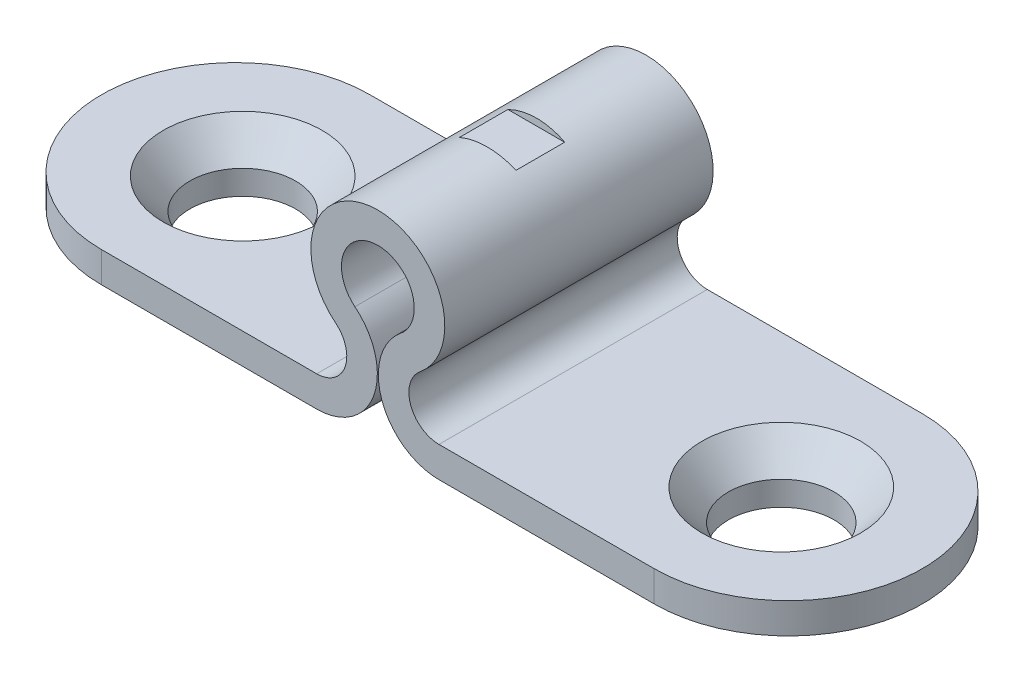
ISO-10303-21;
HEADER;
FILE_DESCRIPTION(('STEP AP214'),'2;1');
FILE_NAME('part.step','',(''),(''),'','','');
FILE_SCHEMA(('AUTOMOTIVE_DESIGN { 1 0 10303 214 1 1 1 1 }'));
ENDSEC;
DATA;
#1=APPLICATION_CONTEXT('core data for automotive mechanical design processes');
#2=APPLICATION_PROTOCOL_DEFINITION('international standard','automotive_design',2000,#1);
#3=PRODUCT_CONTEXT('',#1,'mechanical');
#4=PRODUCT('Part','Part','',(#3));
#5=PRODUCT_RELATED_PRODUCT_CATEGORY('part','',(#4));
#6=PRODUCT_DEFINITION_FORMATION('','',#4);
#7=PRODUCT_DEFINITION_CONTEXT('part definition',#1,'design');
#8=PRODUCT_DEFINITION('design','',#6,#7);
#9=PRODUCT_DEFINITION_SHAPE('','',#8);
#10=(LENGTH_UNIT() NAMED_UNIT(*) SI_UNIT(.MILLI.,.METRE.));
#11=(NAMED_UNIT(*) PLANE_ANGLE_UNIT() SI_UNIT($,.RADIAN.));
#12=(NAMED_UNIT(*) SI_UNIT($,.STERADIAN.) SOLID_ANGLE_UNIT());
#13=UNCERTAINTY_MEASURE_WITH_UNIT(LENGTH_MEASURE(1.E-05),#10,'distance_accuracy_value','');
#14=(GEOMETRIC_REPRESENTATION_CONTEXT(3) GLOBAL_UNCERTAINTY_ASSIGNED_CONTEXT((#13)) GLOBAL_UNIT_ASSIGNED_CONTEXT((#10,
#11,#12)) REPRESENTATION_CONTEXT('',''));
#15=CARTESIAN_POINT('',(0.,0.,0.));
#16=DIRECTION('',(0.,0.,1.));
#17=DIRECTION('',(1.,0.,0.));
#18=AXIS2_PLACEMENT_3D('',#15,#16,#17);
#19=CARTESIAN_POINT('',(-21.4884,0.0680967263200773,7.0231));
#20=DIRECTION('',(0.,1.,0.));
#21=DIRECTION('',(-1.,0.,0.));
#22=AXIS2_PLACEMENT_3D('',#19,#20,#21);
#23=PLANE('',#22);
#24=CARTESIAN_POINT('',(-14.097,0.068096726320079,0.));
#25=DIRECTION('',(0.,1.,0.));
#26=DIRECTION('',(-1.,0.,0.));
#27=AXIS2_PLACEMENT_3D('',#24,#25,#26);
#28=CIRCLE('',#27,5.1308);
#29=CARTESIAN_POINT('',(-19.2278,0.0680967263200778,0.));
#30=VERTEX_POINT('',#29);
#31=EDGE_CURVE('E11',#30,#30,#28,.T.);
#32=ORIENTED_EDGE('',*,*,#31,.T.);
#33=EDGE_LOOP('',(#32));
#34=FACE_BOUND('',#33,.T.);
#35=DIRECTION('',(1.,0.,0.));
#36=VECTOR('',#35,1.);
#37=CARTESIAN_POINT('',(-21.4884,0.0680967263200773,7.0231));
#38=LINE('',#37,#36);
#39=CARTESIAN_POINT('',(-14.4653,0.0680967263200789,7.0231));
#40=VERTEX_POINT('',#39);
#41=CARTESIAN_POINT('',(-3.2004,0.0680967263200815,7.0231));
#42=VERTEX_POINT('',#41);
#43=EDGE_CURVE('E195',#40,#42,#38,.T.);
#44=ORIENTED_EDGE('',*,*,#43,.F.);
#45=CARTESIAN_POINT('',(-14.4653,0.0680967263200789,0.));
#46=DIRECTION('',(0.,1.,0.));
#47=DIRECTION('',(-1.,0.,0.));
#48=AXIS2_PLACEMENT_3D('',#45,#46,#47);
#49=CIRCLE('',#48,7.0231);
#50=CARTESIAN_POINT('',(-14.4653,0.0680967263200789,-7.0231));
#51=VERTEX_POINT('',#50);
#52=EDGE_CURVE('E56',#40,#51,#49,.F.);
#53=ORIENTED_EDGE('',*,*,#52,.T.);
#54=DIRECTION('',(1.,0.,0.));
#55=VECTOR('',#54,1.);
#56=CARTESIAN_POINT('',(-21.4884,0.0680967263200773,-7.0231));
#57=LINE('',#56,#55);
#58=CARTESIAN_POINT('',(-3.2004,0.0680967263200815,-7.0231));
#59=VERTEX_POINT('',#58);
#60=EDGE_CURVE('E218',#51,#59,#57,.T.);
#61=ORIENTED_EDGE('',*,*,#60,.T.);
#62=DIRECTION('',(0.,0.,-1.));
#63=VECTOR('',#62,1.);
#64=CARTESIAN_POINT('',(-3.2004,0.0680967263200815,7.0231));
#65=LINE('',#64,#63);
#66=EDGE_CURVE('E234',#42,#59,#65,.T.);
#67=ORIENTED_EDGE('',*,*,#66,.F.);
#68=EDGE_LOOP('',(#44,#53,#61,#67));
#69=FACE_BOUND('',#68,.T.);
#70=ADVANCED_FACE('F34',(#34,#69),#23,.F.);
#71=CARTESIAN_POINT('',(-14.4653,0.0680967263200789,0.));
#72=DIRECTION('',(0.,-1.,0.));
#73=DIRECTION('',(0.,0.,-1.));
#74=AXIS2_PLACEMENT_3D('',#71,#72,#73);
#75=CYLINDRICAL_SURFACE('',#74,7.0231);
#76=DIRECTION('',(0.,1.,0.));
#77=VECTOR('',#76,1.);
#78=CARTESIAN_POINT('',(-14.4653,0.0680967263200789,-7.0231));
#79=LINE('',#78,#77);
#80=CARTESIAN_POINT('',(-14.4653,1.66829672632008,-7.0231));
#81=VERTEX_POINT('',#80);
#82=EDGE_CURVE('E259',#51,#81,#79,.T.);
#83=ORIENTED_EDGE('',*,*,#82,.F.);
#84=ORIENTED_EDGE('',*,*,#52,.F.);
#85=DIRECTION('',(0.,-1.,0.));
#86=VECTOR('',#85,1.);
#87=CARTESIAN_POINT('',(-14.4653,3.24309672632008,7.0231));
#88=LINE('',#87,#86);
#89=CARTESIAN_POINT('',(-14.4653,1.66829672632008,7.0231));
#90=VERTEX_POINT('',#89);
#91=EDGE_CURVE('E262',#90,#40,#88,.T.);
#92=ORIENTED_EDGE('',*,*,#91,.F.);
#93=CARTESIAN_POINT('',(-14.4653,1.66829672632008,0.));
#94=DIRECTION('',(0.,-1.,0.));
#95=DIRECTION('',(1.,0.,0.));
#96=AXIS2_PLACEMENT_3D('',#93,#94,#95);
#97=CIRCLE('',#96,7.0231);
#98=EDGE_CURVE('E265',#81,#90,#97,.F.);
#99=ORIENTED_EDGE('',*,*,#98,.F.);
#100=EDGE_LOOP('',(#83,#84,#92,#99));
#101=FACE_BOUND('',#100,.T.);
#102=ADVANCED_FACE('F293',(#101),#75,.T.);
#103=CARTESIAN_POINT('',(14.4653,0.0680967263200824,0.));
#104=DIRECTION('',(0.,1.,0.));
#105=DIRECTION('',(0.,0.,1.));
#106=AXIS2_PLACEMENT_3D('',#103,#104,#105);
#107=CYLINDRICAL_SURFACE('',#106,7.0231);
#108=DIRECTION('',(0.,1.,0.));
#109=VECTOR('',#108,1.);
#110=CARTESIAN_POINT('',(14.4653,3.24309672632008,7.0231));
#111=LINE('',#110,#109);
#112=CARTESIAN_POINT('',(14.4653,0.0680967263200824,7.0231));
#113=VERTEX_POINT('',#112);
#114=CARTESIAN_POINT('',(14.4653,1.66829672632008,7.0231));
#115=VERTEX_POINT('',#114);
#116=EDGE_CURVE('E249',#113,#115,#111,.T.);
#117=ORIENTED_EDGE('',*,*,#116,.F.);
#118=CARTESIAN_POINT('',(14.4653,0.0680967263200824,0.));
#119=DIRECTION('',(0.,1.,0.));
#120=DIRECTION('',(-1.,0.,0.));
#121=AXIS2_PLACEMENT_3D('',#118,#119,#120);
#122=CIRCLE('',#121,7.0231);
#123=CARTESIAN_POINT('',(14.4653,0.0680967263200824,-7.0231));
#124=VERTEX_POINT('',#123);
#125=EDGE_CURVE('E255',#124,#113,#122,.F.);
#126=ORIENTED_EDGE('',*,*,#125,.F.);
#127=DIRECTION('',(0.,-1.,0.));
#128=VECTOR('',#127,1.);
#129=CARTESIAN_POINT('',(14.4653,0.0680967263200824,-7.0231));
#130=LINE('',#129,#128);
#131=CARTESIAN_POINT('',(14.4653,1.66829672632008,-7.0231));
#132=VERTEX_POINT('',#131);
#133=EDGE_CURVE('E252',#132,#124,#130,.T.);
#134=ORIENTED_EDGE('',*,*,#133,.F.);
#135=CARTESIAN_POINT('',(14.4653,1.66829672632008,0.));
#136=DIRECTION('',(0.,-1.,0.));
#137=DIRECTION('',(1.,0.,0.));
#138=AXIS2_PLACEMENT_3D('',#135,#136,#137);
#139=CIRCLE('',#138,7.0231);
#140=EDGE_CURVE('E257',#115,#132,#139,.F.);
#141=ORIENTED_EDGE('',*,*,#140,.F.);
#142=EDGE_LOOP('',(#117,#126,#134,#141));
#143=FACE_BOUND('',#142,.T.);
#144=ADVANCED_FACE('F299',(#143),#107,.T.);
#145=CARTESIAN_POINT('',(21.4884,0.0680967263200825,7.0231));
#146=DIRECTION('',(0.,1.,0.));
#147=DIRECTION('',(-1.,0.,0.));
#148=AXIS2_PLACEMENT_3D('',#145,#146,#147);
#149=PLANE('',#148);
#150=CARTESIAN_POINT('',(14.097,0.0680967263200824,0.));
#151=DIRECTION('',(0.,1.,0.));
#152=DIRECTION('',(-1.,0.,0.));
#153=AXIS2_PLACEMENT_3D('',#150,#151,#152);
#154=CIRCLE('',#153,5.1308);
#155=CARTESIAN_POINT('',(8.9662,0.0680967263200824,0.));
#156=VERTEX_POINT('',#155);
#157=EDGE_CURVE('E267',#156,#156,#154,.T.);
#158=ORIENTED_EDGE('',*,*,#157,.T.);
#159=EDGE_LOOP('',(#158));
#160=FACE_BOUND('',#159,.T.);
#161=DIRECTION('',(1.,0.,0.));
#162=VECTOR('',#161,1.);
#163=CARTESIAN_POINT('',(21.4884,0.0680967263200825,-7.0231));
#164=LINE('',#163,#162);
#165=CARTESIAN_POINT('',(3.2004,0.0680967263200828,-7.0231));
#166=VERTEX_POINT('',#165);
#167=EDGE_CURVE('E179',#166,#124,#164,.T.);
#168=ORIENTED_EDGE('',*,*,#167,.T.);
#169=ORIENTED_EDGE('',*,*,#125,.T.);
#170=DIRECTION('',(1.,0.,0.));
#171=VECTOR('',#170,1.);
#172=CARTESIAN_POINT('',(21.4884,0.0680967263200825,7.0231));
#173=LINE('',#172,#171);
#174=CARTESIAN_POINT('',(3.2004,0.0680967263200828,7.0231));
#175=VERTEX_POINT('',#174);
#176=EDGE_CURVE('E180',#175,#113,#173,.T.);
#177=ORIENTED_EDGE('',*,*,#176,.F.);
#178=DIRECTION('',(0.,0.,-1.));
#179=VECTOR('',#178,1.);
#180=CARTESIAN_POINT('',(3.2004,0.0680967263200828,7.0231));
#181=LINE('',#180,#179);
#182=EDGE_CURVE('E203',#175,#166,#181,.T.);
#183=ORIENTED_EDGE('',*,*,#182,.T.);
#184=EDGE_LOOP('',(#168,#169,#177,#183));
#185=FACE_BOUND('',#184,.T.);
#186=ADVANCED_FACE('F323',(#160,#185),#149,.F.);
#187=CARTESIAN_POINT('',(21.4884,1.66829672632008,7.0231));
#188=DIRECTION('',(0.,-1.,0.));
#189=DIRECTION('',(1.,0.,0.));
#190=AXIS2_PLACEMENT_3D('',#187,#188,#189);
#191=PLANE('',#190);
#192=CARTESIAN_POINT('',(14.097,1.66829672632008,0.));
#193=DIRECTION('',(0.,-1.,0.));
#194=DIRECTION('',(1.,0.,0.));
#195=AXIS2_PLACEMENT_3D('',#192,#193,#194);
#196=CIRCLE('',#195,4.15963263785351);
#197=CARTESIAN_POINT('',(18.2566326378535,1.66829672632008,0.));
#198=VERTEX_POINT('',#197);
#199=EDGE_CURVE('E166',#198,#198,#196,.T.);
#200=ORIENTED_EDGE('',*,*,#199,.T.);
#201=EDGE_LOOP('',(#200));
#202=FACE_BOUND('',#201,.T.);
#203=DIRECTION('',(-1.,0.,0.));
#204=VECTOR('',#203,1.);
#205=CARTESIAN_POINT('',(21.4884,1.66829672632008,7.0231));
#206=LINE('',#205,#204);
#207=CARTESIAN_POINT('',(3.2004,1.66829672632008,7.0231));
#208=VERTEX_POINT('',#207);
#209=EDGE_CURVE('E183',#115,#208,#206,.T.);
#210=ORIENTED_EDGE('',*,*,#209,.F.);
#211=ORIENTED_EDGE('',*,*,#140,.T.);
#212=DIRECTION('',(-1.,0.,0.));
#213=VECTOR('',#212,1.);
#214=CARTESIAN_POINT('',(21.4884,1.66829672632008,-7.0231));
#215=LINE('',#214,#213);
#216=CARTESIAN_POINT('',(3.2004,1.66829672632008,-7.0231));
#217=VERTEX_POINT('',#216);
#218=EDGE_CURVE('E206',#132,#217,#215,.T.);
#219=ORIENTED_EDGE('',*,*,#218,.T.);
#220=DIRECTION('',(0.,0.,-1.));
#221=VECTOR('',#220,1.);
#222=CARTESIAN_POINT('',(3.2004,1.66829672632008,7.0231));
#223=LINE('',#222,#221);
#224=EDGE_CURVE('E246',#208,#217,#223,.T.);
#225=ORIENTED_EDGE('',*,*,#224,.F.);
#226=EDGE_LOOP('',(#210,#211,#219,#225));
#227=FACE_BOUND('',#226,.T.);
#228=ADVANCED_FACE('F319',(#202,#227),#191,.F.);
#229=CARTESIAN_POINT('',(3.2004,3.24309672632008,7.0231));
#230=DIRECTION('',(0.,0.,-1.));
#231=DIRECTION('',(-1.,0.,0.));
#232=AXIS2_PLACEMENT_3D('',#229,#230,#231);
#233=CYLINDRICAL_SURFACE('',#232,1.5748);
#234=CARTESIAN_POINT('',(3.2004,3.24309672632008,-7.0231));
#235=DIRECTION('',(0.,0.,-1.));
#236=DIRECTION('',(-1.,0.,0.));
#237=AXIS2_PLACEMENT_3D('',#234,#235,#236);
#238=CIRCLE('',#237,1.5748);
#239=CARTESIAN_POINT('',(2.208276,4.46607874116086,-7.0231));
#240=VERTEX_POINT('',#239);
#241=EDGE_CURVE('E208',#217,#240,#238,.T.);
#242=ORIENTED_EDGE('',*,*,#241,.T.);
#243=DIRECTION('',(0.,0.,-1.));
#244=VECTOR('',#243,1.);
#245=CARTESIAN_POINT('',(2.208276,4.46607874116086,7.0231));
#246=LINE('',#245,#244);
#247=CARTESIAN_POINT('',(2.208276,4.46607874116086,7.0231));
#248=VERTEX_POINT('',#247);
#249=EDGE_CURVE('E243',#248,#240,#246,.T.);
#250=ORIENTED_EDGE('',*,*,#249,.F.);
#251=CARTESIAN_POINT('',(3.2004,3.24309672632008,7.0231));
#252=DIRECTION('',(0.,0.,-1.));
#253=DIRECTION('',(-1.,0.,0.));
#254=AXIS2_PLACEMENT_3D('',#251,#252,#253);
#255=CIRCLE('',#254,1.5748);
#256=EDGE_CURVE('E186',#208,#248,#255,.T.);
#257=ORIENTED_EDGE('',*,*,#256,.F.);
#258=ORIENTED_EDGE('',*,*,#224,.T.);
#259=EDGE_LOOP('',(#242,#250,#257,#258));
#260=FACE_BOUND('',#259,.T.);
#261=ADVANCED_FACE('F316',(#260),#233,.F.);
#262=CARTESIAN_POINT('',(0.,7.1882,7.0231));
#263=DIRECTION('',(0.,0.,-1.));
#264=DIRECTION('',(-1.,0.,0.));
#265=AXIS2_PLACEMENT_3D('',#262,#263,#264);
#266=CYLINDRICAL_SURFACE('',#265,3.5052);
#267=DIRECTION('',(0.,0.,-1.));
#268=VECTOR('',#267,1.);
#269=CARTESIAN_POINT('',(-1.4856753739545,10.3629749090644,7.0231));
#270=LINE('',#269,#268);
#271=CARTESIAN_POINT('',(-1.4856753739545,10.3629749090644,-1.27));
#272=VERTEX_POINT('',#271);
#273=CARTESIAN_POINT('',(-1.4856753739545,10.3629749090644,1.27));
#274=VERTEX_POINT('',#273);
#275=EDGE_CURVE('E141',#272,#274,#270,.F.);
#276=ORIENTED_EDGE('',*,*,#275,.F.);
#277=CARTESIAN_POINT('',(0.,7.1882,-0.992243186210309));
#278=DIRECTION('',(0.,-0.0871557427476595,-0.996194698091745));
#279=DIRECTION('',(0.,0.996194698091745,-0.0871557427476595));
#280=AXIS2_PLACEMENT_3D('',#277,#278,#279);
#281=ELLIPSE('',#280,3.51858929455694,3.5052);
#282=CARTESIAN_POINT('',(1.4856753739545,10.3629749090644,-1.27));
#283=VERTEX_POINT('',#282);
#284=EDGE_CURVE('E149',#283,#272,#281,.F.);
#285=ORIENTED_EDGE('',*,*,#284,.F.);
#286=DIRECTION('',(0.,0.,-1.));
#287=VECTOR('',#286,1.);
#288=CARTESIAN_POINT('',(1.4856753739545,10.3629749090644,7.0231));
#289=LINE('',#288,#287);
#290=CARTESIAN_POINT('',(1.4856753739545,10.3629749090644,1.27));
#291=VERTEX_POINT('',#290);
#292=EDGE_CURVE('E138',#283,#291,#289,.F.);
#293=ORIENTED_EDGE('',*,*,#292,.T.);
#294=CARTESIAN_POINT('',(0.,7.1882,0.992243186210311));
#295=DIRECTION('',(0.,-0.0871557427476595,0.996194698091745));
#296=DIRECTION('',(0.,-0.996194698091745,-0.0871557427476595));
#297=AXIS2_PLACEMENT_3D('',#294,#295,#296);
#298=ELLIPSE('',#297,3.51858929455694,3.5052);
#299=EDGE_CURVE('E146',#274,#291,#298,.F.);
#300=ORIENTED_EDGE('',*,*,#299,.F.);
#301=EDGE_LOOP('',(#276,#285,#293,#300));
#302=FACE_BOUND('',#301,.T.);
#303=CARTESIAN_POINT('',(0.,7.1882,-7.0231));
#304=DIRECTION('',(0.,0.,1.));
#305=DIRECTION('',(1.,0.,0.));
#306=AXIS2_PLACEMENT_3D('',#303,#304,#305);
#307=CIRCLE('',#306,3.5052);
#308=CARTESIAN_POINT('',(-2.208276,4.46607874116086,-7.0231));
#309=VERTEX_POINT('',#308);
#310=EDGE_CURVE('E211',#240,#309,#307,.T.);
#311=ORIENTED_EDGE('',*,*,#310,.T.);
#312=DIRECTION('',(0.,0.,-1.));
#313=VECTOR('',#312,1.);
#314=CARTESIAN_POINT('',(-2.208276,4.46607874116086,7.0231));
#315=LINE('',#314,#313);
#316=CARTESIAN_POINT('',(-2.208276,4.46607874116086,7.0231));
#317=VERTEX_POINT('',#316);
#318=EDGE_CURVE('E240',#317,#309,#315,.T.);
#319=ORIENTED_EDGE('',*,*,#318,.F.);
#320=CARTESIAN_POINT('',(0.,7.1882,7.0231));
#321=DIRECTION('',(0.,0.,1.));
#322=DIRECTION('',(-1.,0.,0.));
#323=AXIS2_PLACEMENT_3D('',#320,#321,#322);
#324=CIRCLE('',#323,3.5052);
#325=EDGE_CURVE('E188',#248,#317,#324,.T.);
#326=ORIENTED_EDGE('',*,*,#325,.F.);
#327=ORIENTED_EDGE('',*,*,#249,.T.);
#328=EDGE_LOOP('',(#311,#319,#326,#327));
#329=FACE_BOUND('',#328,.T.);
#330=ADVANCED_FACE('F151',(#302,#329),#266,.T.);
#331=CARTESIAN_POINT('',(-3.2004,3.24309672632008,7.0231));
#332=DIRECTION('',(0.,0.,-1.));
#333=DIRECTION('',(-1.,0.,0.));
#334=AXIS2_PLACEMENT_3D('',#331,#332,#333);
#335=CYLINDRICAL_SURFACE('',#334,1.5748);
#336=CARTESIAN_POINT('',(-3.2004,3.24309672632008,-7.0231));
#337=DIRECTION('',(0.,0.,-1.));
#338=DIRECTION('',(1.,0.,0.));
#339=AXIS2_PLACEMENT_3D('',#336,#337,#338);
#340=CIRCLE('',#339,1.5748);
#341=CARTESIAN_POINT('',(-3.2004,1.66829672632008,-7.0231));
#342=VERTEX_POINT('',#341);
#343=EDGE_CURVE('E213',#309,#342,#340,.T.);
#344=ORIENTED_EDGE('',*,*,#343,.T.);
#345=DIRECTION('',(0.,0.,-1.));
#346=VECTOR('',#345,1.);
#347=CARTESIAN_POINT('',(-3.2004,1.66829672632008,7.0231));
#348=LINE('',#347,#346);
#349=CARTESIAN_POINT('',(-3.2004,1.66829672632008,7.0231));
#350=VERTEX_POINT('',#349);
#351=EDGE_CURVE('E237',#350,#342,#348,.T.);
#352=ORIENTED_EDGE('',*,*,#351,.F.);
#353=CARTESIAN_POINT('',(-3.2004,3.24309672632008,7.0231));
#354=DIRECTION('',(0.,0.,-1.));
#355=DIRECTION('',(1.,0.,0.));
#356=AXIS2_PLACEMENT_3D('',#353,#354,#355);
#357=CIRCLE('',#356,1.5748);
#358=EDGE_CURVE('E190',#317,#350,#357,.T.);
#359=ORIENTED_EDGE('',*,*,#358,.F.);
#360=ORIENTED_EDGE('',*,*,#318,.T.);
#361=EDGE_LOOP('',(#344,#352,#359,#360));
#362=FACE_BOUND('',#361,.T.);
#363=ADVANCED_FACE('F309',(#362),#335,.F.);
#364=CARTESIAN_POINT('',(-21.4884,1.66829672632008,7.0231));
#365=DIRECTION('',(0.,-1.,0.));
#366=DIRECTION('',(1.,0.,0.));
#367=AXIS2_PLACEMENT_3D('',#364,#365,#366);
#368=PLANE('',#367);
#369=CARTESIAN_POINT('',(-14.097,1.66829672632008,0.));
#370=DIRECTION('',(0.,-1.,0.));
#371=DIRECTION('',(1.,0.,0.));
#372=AXIS2_PLACEMENT_3D('',#369,#370,#371);
#373=CIRCLE('',#372,4.15963263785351);
#374=CARTESIAN_POINT('',(-9.93736736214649,1.66829672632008,0.));
#375=VERTEX_POINT('',#374);
#376=EDGE_CURVE('E176',#375,#375,#373,.T.);
#377=ORIENTED_EDGE('',*,*,#376,.T.);
#378=EDGE_LOOP('',(#377));
#379=FACE_BOUND('',#378,.T.);
#380=DIRECTION('',(-1.,0.,0.));
#381=VECTOR('',#380,1.);
#382=CARTESIAN_POINT('',(-21.4884,1.66829672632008,-7.0231));
#383=LINE('',#382,#381);
#384=EDGE_CURVE('E215',#342,#81,#383,.T.);
#385=ORIENTED_EDGE('',*,*,#384,.T.);
#386=ORIENTED_EDGE('',*,*,#98,.T.);
#387=DIRECTION('',(-1.,0.,0.));
#388=VECTOR('',#387,1.);
#389=CARTESIAN_POINT('',(-21.4884,1.66829672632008,7.0231));
#390=LINE('',#389,#388);
#391=EDGE_CURVE('E192',#350,#90,#390,.T.);
#392=ORIENTED_EDGE('',*,*,#391,.F.);
#393=ORIENTED_EDGE('',*,*,#351,.T.);
#394=EDGE_LOOP('',(#385,#386,#392,#393));
#395=FACE_BOUND('',#394,.T.);
#396=ADVANCED_FACE('F306',(#379,#395),#368,.F.);
#397=CARTESIAN_POINT('',(-3.2004,3.24309672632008,7.0231));
#398=DIRECTION('',(0.,0.,-1.));
#399=DIRECTION('',(-1.,0.,0.));
#400=AXIS2_PLACEMENT_3D('',#397,#398,#399);
#401=CYLINDRICAL_SURFACE('',#400,3.175);
#402=CARTESIAN_POINT('',(-3.2004,3.24309672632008,-7.0231));
#403=DIRECTION('',(0.,0.,1.));
#404=DIRECTION('',(1.,0.,0.));
#405=AXIS2_PLACEMENT_3D('',#402,#403,#404);
#406=CIRCLE('',#405,3.175);
#407=CARTESIAN_POINT('',(-1.20015,5.70878627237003,-7.0231));
#408=VERTEX_POINT('',#407);
#409=EDGE_CURVE('E220',#59,#408,#406,.T.);
#410=ORIENTED_EDGE('',*,*,#409,.T.);
#411=DIRECTION('',(0.,0.,-1.));
#412=VECTOR('',#411,1.);
#413=CARTESIAN_POINT('',(-1.20015,5.70878627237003,7.0231));
#414=LINE('',#413,#412);
#415=CARTESIAN_POINT('',(-1.20015,5.70878627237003,7.0231));
#416=VERTEX_POINT('',#415);
#417=EDGE_CURVE('E231',#416,#408,#414,.T.);
#418=ORIENTED_EDGE('',*,*,#417,.F.);
#419=CARTESIAN_POINT('',(-3.2004,3.24309672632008,7.0231));
#420=DIRECTION('',(0.,0.,1.));
#421=DIRECTION('',(1.,0.,0.));
#422=AXIS2_PLACEMENT_3D('',#419,#420,#421);
#423=CIRCLE('',#422,3.175);
#424=EDGE_CURVE('E197',#42,#416,#423,.T.);
#425=ORIENTED_EDGE('',*,*,#424,.F.);
#426=ORIENTED_EDGE('',*,*,#66,.T.);
#427=EDGE_LOOP('',(#410,#418,#425,#426));
#428=FACE_BOUND('',#427,.T.);
#429=ADVANCED_FACE('F304',(#428),#401,.T.);
#430=CARTESIAN_POINT('',(0.,7.1882,7.0231));
#431=DIRECTION('',(0.,0.,-1.));
#432=DIRECTION('',(-1.,0.,0.));
#433=AXIS2_PLACEMENT_3D('',#430,#431,#432);
#434=CYLINDRICAL_SURFACE('',#433,1.905);
#435=CARTESIAN_POINT('',(0.,7.1882,-7.0231));
#436=DIRECTION('',(0.,0.,-1.));
#437=DIRECTION('',(-1.,0.,0.));
#438=AXIS2_PLACEMENT_3D('',#435,#436,#437);
#439=CIRCLE('',#438,1.905);
#440=CARTESIAN_POINT('',(1.20015,5.70878627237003,-7.0231));
#441=VERTEX_POINT('',#440);
#442=EDGE_CURVE('E223',#408,#441,#439,.T.);
#443=ORIENTED_EDGE('',*,*,#442,.T.);
#444=DIRECTION('',(0.,0.,-1.));
#445=VECTOR('',#444,1.);
#446=CARTESIAN_POINT('',(1.20015,5.70878627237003,7.0231));
#447=LINE('',#446,#445);
#448=CARTESIAN_POINT('',(1.20015,5.70878627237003,7.0231));
#449=VERTEX_POINT('',#448);
#450=EDGE_CURVE('E228',#449,#441,#447,.T.);
#451=ORIENTED_EDGE('',*,*,#450,.F.);
#452=CARTESIAN_POINT('',(0.,7.1882,7.0231));
#453=DIRECTION('',(0.,0.,-1.));
#454=DIRECTION('',(1.,0.,0.));
#455=AXIS2_PLACEMENT_3D('',#452,#453,#454);
#456=CIRCLE('',#455,1.905);
#457=EDGE_CURVE('E199',#416,#449,#456,.T.);
#458=ORIENTED_EDGE('',*,*,#457,.F.);
#459=ORIENTED_EDGE('',*,*,#417,.T.);
#460=EDGE_LOOP('',(#443,#451,#458,#459));
#461=FACE_BOUND('',#460,.T.);
#462=ADVANCED_FACE('F375',(#461),#434,.F.);
#463=CARTESIAN_POINT('',(3.2004,3.24309672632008,7.0231));
#464=DIRECTION('',(0.,0.,-1.));
#465=DIRECTION('',(-1.,0.,0.));
#466=AXIS2_PLACEMENT_3D('',#463,#464,#465);
#467=CYLINDRICAL_SURFACE('',#466,3.175);
#468=CARTESIAN_POINT('',(3.2004,3.24309672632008,-7.0231));
#469=DIRECTION('',(0.,0.,1.));
#470=DIRECTION('',(-1.,0.,0.));
#471=AXIS2_PLACEMENT_3D('',#468,#469,#470);
#472=CIRCLE('',#471,3.175);
#473=EDGE_CURVE('E184',#441,#166,#472,.T.);
#474=ORIENTED_EDGE('',*,*,#473,.T.);
#475=ORIENTED_EDGE('',*,*,#182,.F.);
#476=CARTESIAN_POINT('',(3.2004,3.24309672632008,7.0231));
#477=DIRECTION('',(0.,0.,1.));
#478=DIRECTION('',(-1.,0.,0.));
#479=AXIS2_PLACEMENT_3D('',#476,#477,#478);
#480=CIRCLE('',#479,3.175);
#481=EDGE_CURVE('E201',#449,#175,#480,.T.);
#482=ORIENTED_EDGE('',*,*,#481,.F.);
#483=ORIENTED_EDGE('',*,*,#450,.T.);
#484=EDGE_LOOP('',(#474,#475,#482,#483));
#485=FACE_BOUND('',#484,.T.);
#486=ADVANCED_FACE('F377',(#485),#467,.T.);
#487=CARTESIAN_POINT('',(3.2004,3.24309672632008,7.0231));
#488=DIRECTION('',(0.,0.,-1.));
#489=DIRECTION('',(-1.,0.,0.));
#490=AXIS2_PLACEMENT_3D('',#487,#488,#489);
#491=PLANE('',#490);
#492=ORIENTED_EDGE('',*,*,#391,.T.);
#493=ORIENTED_EDGE('',*,*,#91,.T.);
#494=ORIENTED_EDGE('',*,*,#43,.T.);
#495=ORIENTED_EDGE('',*,*,#424,.T.);
#496=ORIENTED_EDGE('',*,*,#457,.T.);
#497=ORIENTED_EDGE('',*,*,#481,.T.);
#498=ORIENTED_EDGE('',*,*,#176,.T.);
#499=ORIENTED_EDGE('',*,*,#116,.T.);
#500=ORIENTED_EDGE('',*,*,#209,.T.);
#501=ORIENTED_EDGE('',*,*,#256,.T.);
#502=ORIENTED_EDGE('',*,*,#325,.T.);
#503=ORIENTED_EDGE('',*,*,#358,.T.);
#504=EDGE_LOOP('',(#492,#493,#494,#495,#496,#497,#498,#499,#500,#501,#502,#503));
#505=FACE_BOUND('',#504,.T.);
#506=ADVANCED_FACE('F343',(#505),#491,.F.);
#507=CARTESIAN_POINT('',(3.2004,3.24309672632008,-7.0231));
#508=DIRECTION('',(0.,0.,-1.));
#509=DIRECTION('',(-1.,0.,0.));
#510=AXIS2_PLACEMENT_3D('',#507,#508,#509);
#511=PLANE('',#510);
#512=ORIENTED_EDGE('',*,*,#60,.F.);
#513=ORIENTED_EDGE('',*,*,#82,.T.);
#514=ORIENTED_EDGE('',*,*,#384,.F.);
#515=ORIENTED_EDGE('',*,*,#343,.F.);
#516=ORIENTED_EDGE('',*,*,#310,.F.);
#517=ORIENTED_EDGE('',*,*,#241,.F.);
#518=ORIENTED_EDGE('',*,*,#218,.F.);
#519=ORIENTED_EDGE('',*,*,#133,.T.);
#520=ORIENTED_EDGE('',*,*,#167,.F.);
#521=ORIENTED_EDGE('',*,*,#473,.F.);
#522=ORIENTED_EDGE('',*,*,#442,.F.);
#523=ORIENTED_EDGE('',*,*,#409,.F.);
#524=EDGE_LOOP('',(#512,#513,#514,#515,#516,#517,#518,#519,#520,#521,#522,#523));
#525=FACE_BOUND('',#524,.T.);
#526=ADVANCED_FACE('F351',(#525),#511,.T.);
#527=CARTESIAN_POINT('',(-14.097,3.83153849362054,0.));
#528=DIRECTION('',(0.,1.,0.));
#529=DIRECTION('',(0.,0.,1.));
#530=AXIS2_PLACEMENT_3D('',#527,#528,#529);
#531=CONICAL_SURFACE('',#530,6.04011001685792,0.715584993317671);
#532=CARTESIAN_POINT('',(-14.097,0.0680967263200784,0.));
#533=DIRECTION('',(0.,1.,0.));
#534=DIRECTION('',(0.,0.,1.));
#535=AXIS2_PLACEMENT_3D('',#532,#533,#534);
#536=CIRCLE('',#535,2.7686);
#537=CARTESIAN_POINT('',(-14.097,0.0680967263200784,2.7686));
#538=VERTEX_POINT('',#537);
#539=EDGE_CURVE('E173',#538,#538,#536,.T.);
#540=ORIENTED_EDGE('',*,*,#539,.F.);
#541=EDGE_LOOP('',(#540));
#542=FACE_BOUND('',#541,.T.);
#543=ORIENTED_EDGE('',*,*,#376,.F.);
#544=EDGE_LOOP('',(#543));
#545=FACE_BOUND('',#544,.T.);
#546=ADVANCED_FACE('F387',(#542,#545),#531,.F.);
#547=CARTESIAN_POINT('',(-14.097,-1.20190327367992,0.));
#548=DIRECTION('',(0.,-1.,0.));
#549=DIRECTION('',(1.,0.,0.));
#550=AXIS2_PLACEMENT_3D('',#547,#548,#549);
#551=PLANE('',#550);
#552=CARTESIAN_POINT('',(-14.097,-1.20190327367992,0.));
#553=DIRECTION('',(0.,-1.,0.));
#554=DIRECTION('',(1.,0.,0.));
#555=AXIS2_PLACEMENT_3D('',#552,#553,#554);
#556=CIRCLE('',#555,4.3688);
#557=CARTESIAN_POINT('',(-9.7282,-1.20190327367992,0.));
#558=VERTEX_POINT('',#557);
#559=EDGE_CURVE('E170',#558,#558,#556,.T.);
#560=ORIENTED_EDGE('',*,*,#559,.T.);
#561=EDGE_LOOP('',(#560));
#562=FACE_BOUND('',#561,.T.);
#563=CARTESIAN_POINT('',(-14.097,-1.20190327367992,0.));
#564=DIRECTION('',(0.,-1.,0.));
#565=DIRECTION('',(1.,0.,0.));
#566=AXIS2_PLACEMENT_3D('',#563,#564,#565);
#567=CIRCLE('',#566,2.7686);
#568=CARTESIAN_POINT('',(-11.3284,-1.20190327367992,0.));
#569=VERTEX_POINT('',#568);
#570=EDGE_CURVE('E167',#569,#569,#567,.T.);
#571=ORIENTED_EDGE('',*,*,#570,.F.);
#572=EDGE_LOOP('',(#571));
#573=FACE_BOUND('',#572,.T.);
#574=ADVANCED_FACE('F391',(#562,#573),#551,.T.);
#575=CARTESIAN_POINT('',(-14.097,-1.20190327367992,0.));
#576=DIRECTION('',(0.,1.,0.));
#577=DIRECTION('',(-1.,0.,0.));
#578=AXIS2_PLACEMENT_3D('',#575,#576,#577);
#579=CYLINDRICAL_SURFACE('',#578,4.3688);
#580=CARTESIAN_POINT('',(-14.097,-0.693903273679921,0.));
#581=DIRECTION('',(0.,1.,0.));
#582=DIRECTION('',(-1.,0.,0.));
#583=AXIS2_PLACEMENT_3D('',#580,#581,#582);
#584=CIRCLE('',#583,4.3688);
#585=CARTESIAN_POINT('',(-18.4658,-0.693903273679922,0.));
#586=VERTEX_POINT('',#585);
#587=EDGE_CURVE('E42',#586,#586,#584,.F.);
#588=ORIENTED_EDGE('',*,*,#587,.T.);
#589=EDGE_LOOP('',(#588));
#590=FACE_BOUND('',#589,.T.);
#591=ORIENTED_EDGE('',*,*,#559,.F.);
#592=EDGE_LOOP('',(#591));
#593=FACE_BOUND('',#592,.T.);
#594=ADVANCED_FACE('F277',(#590,#593),#579,.T.);
#595=CARTESIAN_POINT('',(-14.097,-1.20190327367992,0.));
#596=DIRECTION('',(0.,1.,0.));
#597=DIRECTION('',(-1.,0.,0.));
#598=AXIS2_PLACEMENT_3D('',#595,#596,#597);
#599=CYLINDRICAL_SURFACE('',#598,2.7686);
#600=ORIENTED_EDGE('',*,*,#570,.T.);
#601=EDGE_LOOP('',(#600));
#602=FACE_BOUND('',#601,.T.);
#603=ORIENTED_EDGE('',*,*,#539,.T.);
#604=EDGE_LOOP('',(#603));
#605=FACE_BOUND('',#604,.T.);
#606=ADVANCED_FACE('F395',(#602,#605),#599,.F.);
#607=CARTESIAN_POINT('',(14.097,3.83153849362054,0.));
#608=DIRECTION('',(0.,1.,0.));
#609=DIRECTION('',(0.,0.,1.));
#610=AXIS2_PLACEMENT_3D('',#607,#608,#609);
#611=CONICAL_SURFACE('',#610,6.04011001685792,0.715584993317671);
#612=CARTESIAN_POINT('',(14.097,0.068096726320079,0.));
#613=DIRECTION('',(0.,1.,0.));
#614=DIRECTION('',(-1.,0.,0.));
#615=AXIS2_PLACEMENT_3D('',#612,#613,#614);
#616=CIRCLE('',#615,2.7686);
#617=CARTESIAN_POINT('',(11.3284,0.0680967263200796,0.));
#618=VERTEX_POINT('',#617);
#619=EDGE_CURVE('E143',#618,#618,#616,.T.);
#620=ORIENTED_EDGE('',*,*,#619,.F.);
#621=EDGE_LOOP('',(#620));
#622=FACE_BOUND('',#621,.T.);
#623=ORIENTED_EDGE('',*,*,#199,.F.);
#624=EDGE_LOOP('',(#623));
#625=FACE_BOUND('',#624,.T.);
#626=ADVANCED_FACE('F401',(#622,#625),#611,.F.);
#627=CARTESIAN_POINT('',(14.097,-1.20190327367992,0.));
#628=DIRECTION('',(0.,1.,0.));
#629=DIRECTION('',(-1.,0.,0.));
#630=AXIS2_PLACEMENT_3D('',#627,#628,#629);
#631=CYLINDRICAL_SURFACE('',#630,4.3688);
#632=CARTESIAN_POINT('',(14.097,-0.693903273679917,0.));
#633=DIRECTION('',(0.,1.,0.));
#634=DIRECTION('',(-1.,0.,0.));
#635=AXIS2_PLACEMENT_3D('',#632,#633,#634);
#636=CIRCLE('',#635,4.3688);
#637=CARTESIAN_POINT('',(9.7282,-0.693903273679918,0.));
#638=VERTEX_POINT('',#637);
#639=EDGE_CURVE('E272',#638,#638,#636,.F.);
#640=ORIENTED_EDGE('',*,*,#639,.T.);
#641=EDGE_LOOP('',(#640));
#642=FACE_BOUND('',#641,.T.);
#643=CARTESIAN_POINT('',(14.097,-1.20190327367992,0.));
#644=DIRECTION('',(0.,1.,0.));
#645=DIRECTION('',(-1.,0.,0.));
#646=AXIS2_PLACEMENT_3D('',#643,#644,#645);
#647=CIRCLE('',#646,4.3688);
#648=CARTESIAN_POINT('',(9.7282,-1.20190327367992,0.));
#649=VERTEX_POINT('',#648);
#650=EDGE_CURVE('E161',#649,#649,#647,.T.);
#651=ORIENTED_EDGE('',*,*,#650,.T.);
#652=EDGE_LOOP('',(#651));
#653=FACE_BOUND('',#652,.T.);
#654=ADVANCED_FACE('F405',(#642,#653),#631,.T.);
#655=CARTESIAN_POINT('',(14.097,-1.20190327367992,0.));
#656=DIRECTION('',(0.,-1.,0.));
#657=DIRECTION('',(-1.,0.,0.));
#658=AXIS2_PLACEMENT_3D('',#655,#656,#657);
#659=PLANE('',#658);
#660=CARTESIAN_POINT('',(14.097,-1.20190327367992,0.));
#661=DIRECTION('',(0.,1.,0.));
#662=DIRECTION('',(-1.,0.,0.));
#663=AXIS2_PLACEMENT_3D('',#660,#661,#662);
#664=CIRCLE('',#663,2.7686);
#665=CARTESIAN_POINT('',(11.3284,-1.20190327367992,0.));
#666=VERTEX_POINT('',#665);
#667=EDGE_CURVE('E158',#666,#666,#664,.T.);
#668=ORIENTED_EDGE('',*,*,#667,.T.);
#669=EDGE_LOOP('',(#668));
#670=FACE_BOUND('',#669,.T.);
#671=ORIENTED_EDGE('',*,*,#650,.F.);
#672=EDGE_LOOP('',(#671));
#673=FACE_BOUND('',#672,.T.);
#674=ADVANCED_FACE('F409',(#670,#673),#659,.T.);
#675=CARTESIAN_POINT('',(14.097,-1.20190327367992,0.));
#676=DIRECTION('',(0.,1.,0.));
#677=DIRECTION('',(-1.,0.,0.));
#678=AXIS2_PLACEMENT_3D('',#675,#676,#677);
#679=CYLINDRICAL_SURFACE('',#678,2.7686);
#680=ORIENTED_EDGE('',*,*,#667,.F.);
#681=EDGE_LOOP('',(#680));
#682=FACE_BOUND('',#681,.T.);
#683=ORIENTED_EDGE('',*,*,#619,.T.);
#684=EDGE_LOOP('',(#683));
#685=FACE_BOUND('',#684,.T.);
#686=ADVANCED_FACE('F289',(#682,#685),#679,.F.);
#687=CARTESIAN_POINT('',(14.097,-0.693903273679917,0.));
#688=DIRECTION('',(0.,1.,0.));
#689=DIRECTION('',(-1.,0.,0.));
#690=AXIS2_PLACEMENT_3D('',#687,#688,#689);
#691=TOROIDAL_SURFACE('',#690,5.1308,0.762);
#692=ORIENTED_EDGE('',*,*,#639,.F.);
#693=EDGE_LOOP('',(#692));
#694=FACE_BOUND('',#693,.T.);
#695=ORIENTED_EDGE('',*,*,#157,.F.);
#696=EDGE_LOOP('',(#695));
#697=FACE_BOUND('',#696,.T.);
#698=ADVANCED_FACE('F281',(#694,#697),#691,.F.);
#699=CARTESIAN_POINT('',(-14.097,-0.693903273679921,0.));
#700=DIRECTION('',(0.,1.,0.));
#701=DIRECTION('',(-1.,0.,0.));
#702=AXIS2_PLACEMENT_3D('',#699,#700,#701);
#703=TOROIDAL_SURFACE('',#702,5.1308,0.762);
#704=ORIENTED_EDGE('',*,*,#31,.F.);
#705=EDGE_LOOP('',(#704));
#706=FACE_BOUND('',#705,.T.);
#707=ORIENTED_EDGE('',*,*,#587,.F.);
#708=EDGE_LOOP('',(#707));
#709=FACE_BOUND('',#708,.T.);
#710=ADVANCED_FACE('F36',(#706,#709),#703,.F.);
#711=CARTESIAN_POINT('',(-21.4894,10.3629749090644,-1.27));
#712=DIRECTION('',(0.,-1.,0.));
#713=DIRECTION('',(0.,0.,-1.));
#714=AXIS2_PLACEMENT_3D('',#711,#712,#713);
#715=PLANE('',#714);
#716=ORIENTED_EDGE('',*,*,#275,.T.);
#717=DIRECTION('',(1.,0.,0.));
#718=VECTOR('',#717,1.);
#719=CARTESIAN_POINT('',(-21.4894,10.3629749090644,1.27));
#720=LINE('',#719,#718);
#721=EDGE_CURVE('E48',#274,#291,#720,.T.);
#722=ORIENTED_EDGE('',*,*,#721,.T.);
#723=ORIENTED_EDGE('',*,*,#292,.F.);
#724=DIRECTION('',(1.,0.,0.));
#725=VECTOR('',#724,1.);
#726=CARTESIAN_POINT('',(-21.4894,10.3629749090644,-1.27));
#727=LINE('',#726,#725);
#728=EDGE_CURVE('E144',#272,#283,#727,.T.);
#729=ORIENTED_EDGE('',*,*,#728,.F.);
#730=EDGE_LOOP('',(#716,#722,#723,#729));
#731=FACE_BOUND('',#730,.T.);
#732=ADVANCED_FACE('F135',(#731),#715,.F.);
#733=CARTESIAN_POINT('',(-21.4894,10.3629749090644,-1.27));
#734=DIRECTION('',(0.,-0.0871557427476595,-0.996194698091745));
#735=DIRECTION('',(0.,0.996194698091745,-0.0871557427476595));
#736=AXIS2_PLACEMENT_3D('',#733,#734,#735);
#737=PLANE('',#736);
#738=ORIENTED_EDGE('',*,*,#284,.T.);
#739=ORIENTED_EDGE('',*,*,#728,.T.);
#740=EDGE_LOOP('',(#738,#739));
#741=FACE_BOUND('',#740,.T.);
#742=ADVANCED_FACE('F287',(#741),#737,.F.);
#743=CARTESIAN_POINT('',(-21.4894,10.3629749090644,1.27));
#744=DIRECTION('',(0.,-0.0871557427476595,0.996194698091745));
#745=DIRECTION('',(0.,-0.996194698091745,-0.0871557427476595));
#746=AXIS2_PLACEMENT_3D('',#743,#744,#745);
#747=PLANE('',#746);
#748=ORIENTED_EDGE('',*,*,#299,.T.);
#749=ORIENTED_EDGE('',*,*,#721,.F.);
#750=EDGE_LOOP('',(#748,#749));
#751=FACE_BOUND('',#750,.T.);
#752=ADVANCED_FACE('F147',(#751),#747,.F.);
#753=CLOSED_SHELL('',(#70,#102,#144,#186,#228,#261,#330,#363,#396,#429,#462,#486,#506,#526,#546,
#574,#594,#606,#626,#654,#674,#686,#698,#710,#732,#742,#752));
#754=MANIFOLD_SOLID_BREP('B2',#753);
#755=ADVANCED_BREP_SHAPE_REPRESENTATION('',(#18,#754),#14);
#756=SHAPE_DEFINITION_REPRESENTATION(#9,#755);
ENDSEC;
END-ISO-10303-21;
